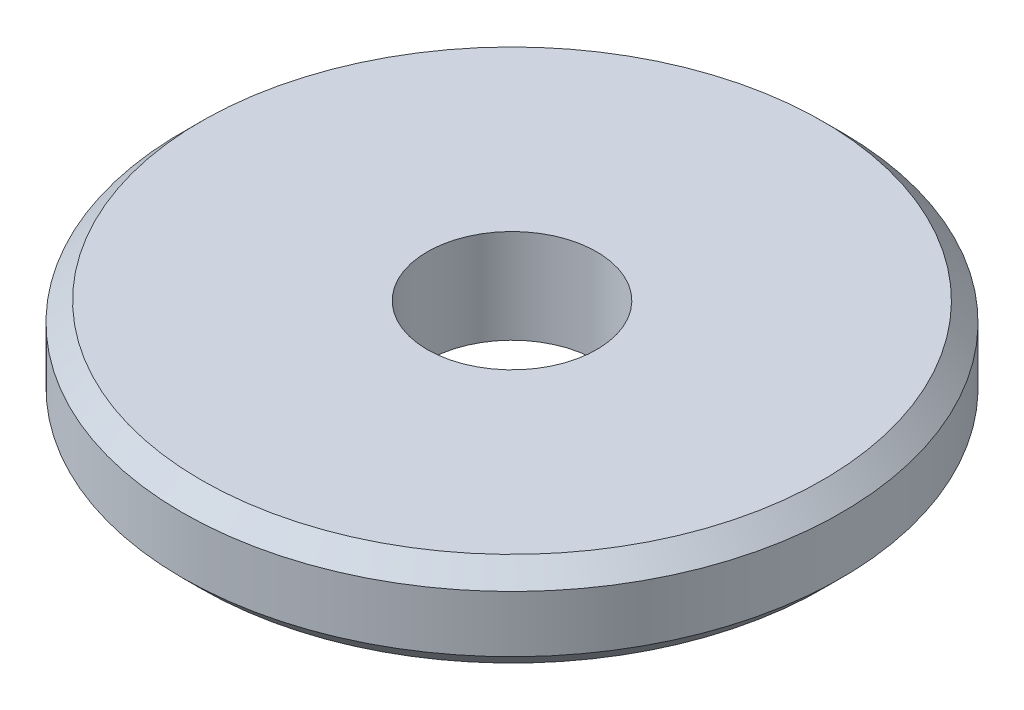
ISO-10303-21;
HEADER;
FILE_DESCRIPTION(('STEP AP214'),'2;1');
FILE_NAME('part.step','',(''),(''),'','','');
FILE_SCHEMA(('AUTOMOTIVE_DESIGN { 1 0 10303 214 1 1 1 1 }'));
ENDSEC;
DATA;
#1=APPLICATION_CONTEXT('core data for automotive mechanical design processes');
#2=APPLICATION_PROTOCOL_DEFINITION('international standard','automotive_design',2000,#1);
#3=PRODUCT_CONTEXT('',#1,'mechanical');
#4=PRODUCT('Part','Part','',(#3));
#5=PRODUCT_RELATED_PRODUCT_CATEGORY('part','',(#4));
#6=PRODUCT_DEFINITION_FORMATION('','',#4);
#7=PRODUCT_DEFINITION_CONTEXT('part definition',#1,'design');
#8=PRODUCT_DEFINITION('design','',#6,#7);
#9=PRODUCT_DEFINITION_SHAPE('','',#8);
#10=(LENGTH_UNIT() NAMED_UNIT(*) SI_UNIT(.MILLI.,.METRE.));
#11=(NAMED_UNIT(*) PLANE_ANGLE_UNIT() SI_UNIT($,.RADIAN.));
#12=(NAMED_UNIT(*) SI_UNIT($,.STERADIAN.) SOLID_ANGLE_UNIT());
#13=UNCERTAINTY_MEASURE_WITH_UNIT(LENGTH_MEASURE(1.E-05),#10,'distance_accuracy_value','');
#14=(GEOMETRIC_REPRESENTATION_CONTEXT(3) GLOBAL_UNCERTAINTY_ASSIGNED_CONTEXT((#13)) GLOBAL_UNIT_ASSIGNED_CONTEXT((#10,
#11,#12)) REPRESENTATION_CONTEXT('',''));
#15=CARTESIAN_POINT('',(0.,0.,0.));
#16=DIRECTION('',(0.,0.,1.));
#17=DIRECTION('',(1.,0.,0.));
#18=AXIS2_PLACEMENT_3D('',#15,#16,#17);
#19=CARTESIAN_POINT('',(0.,5.,0.));
#20=DIRECTION('',(0.,1.,0.));
#21=DIRECTION('',(0.,0.,1.));
#22=AXIS2_PLACEMENT_3D('',#19,#20,#21);
#23=PLANE('',#22);
#24=CARTESIAN_POINT('',(0.,5.,0.));
#25=DIRECTION('',(0.,1.,0.));
#26=DIRECTION('',(0.,0.,1.));
#27=AXIS2_PLACEMENT_3D('',#24,#25,#26);
#28=CIRCLE('',#27,16.5);
#29=CARTESIAN_POINT('',(0.,5.,16.5));
#30=VERTEX_POINT('',#29);
#31=EDGE_CURVE('E10',#30,#30,#28,.T.);
#32=ORIENTED_EDGE('',*,*,#31,.T.);
#33=EDGE_LOOP('',(#32));
#34=FACE_BOUND('',#33,.T.);
#35=CARTESIAN_POINT('',(0.,5.,0.));
#36=DIRECTION('',(0.,1.,0.));
#37=DIRECTION('',(0.,0.,1.));
#38=AXIS2_PLACEMENT_3D('',#35,#36,#37);
#39=CIRCLE('',#38,4.5);
#40=CARTESIAN_POINT('',(0.,5.,4.5));
#41=VERTEX_POINT('',#40);
#42=EDGE_CURVE('E49',#41,#41,#39,.T.);
#43=ORIENTED_EDGE('',*,*,#42,.F.);
#44=EDGE_LOOP('',(#43));
#45=FACE_BOUND('',#44,.T.);
#46=ADVANCED_FACE('F29',(#34,#45),#23,.T.);
#47=CARTESIAN_POINT('',(0.,0.,0.));
#48=DIRECTION('',(0.,1.,0.));
#49=DIRECTION('',(0.,0.,1.));
#50=AXIS2_PLACEMENT_3D('',#47,#48,#49);
#51=PLANE('',#50);
#52=CARTESIAN_POINT('',(0.,0.,0.));
#53=DIRECTION('',(0.,1.,0.));
#54=DIRECTION('',(0.,0.,1.));
#55=AXIS2_PLACEMENT_3D('',#52,#53,#54);
#56=CIRCLE('',#55,16.5);
#57=CARTESIAN_POINT('',(0.,0.,16.5));
#58=VERTEX_POINT('',#57);
#59=EDGE_CURVE('E36',#58,#58,#56,.F.);
#60=ORIENTED_EDGE('',*,*,#59,.T.);
#61=EDGE_LOOP('',(#60));
#62=FACE_BOUND('',#61,.T.);
#63=CARTESIAN_POINT('',(0.,0.,0.));
#64=DIRECTION('',(0.,1.,0.));
#65=DIRECTION('',(0.,0.,1.));
#66=AXIS2_PLACEMENT_3D('',#63,#64,#65);
#67=CIRCLE('',#66,4.5);
#68=CARTESIAN_POINT('',(0.,0.,4.5));
#69=VERTEX_POINT('',#68);
#70=EDGE_CURVE('E50',#69,#69,#67,.T.);
#71=ORIENTED_EDGE('',*,*,#70,.T.);
#72=EDGE_LOOP('',(#71));
#73=FACE_BOUND('',#72,.T.);
#74=ADVANCED_FACE('F60',(#62,#73),#51,.F.);
#75=CARTESIAN_POINT('',(0.,5.,0.));
#76=DIRECTION('',(0.,-1.,0.));
#77=DIRECTION('',(0.,0.,-1.));
#78=AXIS2_PLACEMENT_3D('',#75,#76,#77);
#79=CYLINDRICAL_SURFACE('',#78,17.5);
#80=CARTESIAN_POINT('',(0.,1.00000000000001,0.));
#81=DIRECTION('',(0.,1.,0.));
#82=DIRECTION('',(0.,0.,1.));
#83=AXIS2_PLACEMENT_3D('',#80,#81,#82);
#84=CIRCLE('',#83,17.5);
#85=CARTESIAN_POINT('',(0.,1.00000000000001,17.5));
#86=VERTEX_POINT('',#85);
#87=EDGE_CURVE('E40',#86,#86,#84,.T.);
#88=ORIENTED_EDGE('',*,*,#87,.T.);
#89=EDGE_LOOP('',(#88));
#90=FACE_BOUND('',#89,.T.);
#91=CARTESIAN_POINT('',(0.,4.,0.));
#92=DIRECTION('',(0.,1.,0.));
#93=DIRECTION('',(0.,0.,1.));
#94=AXIS2_PLACEMENT_3D('',#91,#92,#93);
#95=CIRCLE('',#94,17.5);
#96=CARTESIAN_POINT('',(0.,4.,17.5));
#97=VERTEX_POINT('',#96);
#98=EDGE_CURVE('E44',#97,#97,#95,.F.);
#99=ORIENTED_EDGE('',*,*,#98,.T.);
#100=EDGE_LOOP('',(#99));
#101=FACE_BOUND('',#100,.T.);
#102=ADVANCED_FACE('F65',(#90,#101),#79,.T.);
#103=CARTESIAN_POINT('',(0.,5.,0.));
#104=DIRECTION('',(0.,-1.,0.));
#105=DIRECTION('',(0.,0.,-1.));
#106=AXIS2_PLACEMENT_3D('',#103,#104,#105);
#107=CYLINDRICAL_SURFACE('',#106,4.5);
#108=ORIENTED_EDGE('',*,*,#42,.T.);
#109=EDGE_LOOP('',(#108));
#110=FACE_BOUND('',#109,.T.);
#111=ORIENTED_EDGE('',*,*,#70,.F.);
#112=EDGE_LOOP('',(#111));
#113=FACE_BOUND('',#112,.T.);
#114=ADVANCED_FACE('F56',(#110,#113),#107,.F.);
#115=CARTESIAN_POINT('',(0.,1.00000000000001,0.));
#116=DIRECTION('',(0.,1.,0.));
#117=DIRECTION('',(0.,0.,1.));
#118=AXIS2_PLACEMENT_3D('',#115,#116,#117);
#119=CONICAL_SURFACE('',#118,17.5,0.785398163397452);
#120=ORIENTED_EDGE('',*,*,#59,.F.);
#121=EDGE_LOOP('',(#120));
#122=FACE_BOUND('',#121,.T.);
#123=ORIENTED_EDGE('',*,*,#87,.F.);
#124=EDGE_LOOP('',(#123));
#125=FACE_BOUND('',#124,.T.);
#126=ADVANCED_FACE('F71',(#122,#125),#119,.T.);
#127=CARTESIAN_POINT('',(0.,5.,0.));
#128=DIRECTION('',(0.,-1.,0.));
#129=DIRECTION('',(0.,0.,-1.));
#130=AXIS2_PLACEMENT_3D('',#127,#128,#129);
#131=CONICAL_SURFACE('',#130,16.5,0.785398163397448);
#132=ORIENTED_EDGE('',*,*,#98,.F.);
#133=EDGE_LOOP('',(#132));
#134=FACE_BOUND('',#133,.T.);
#135=ORIENTED_EDGE('',*,*,#31,.F.);
#136=EDGE_LOOP('',(#135));
#137=FACE_BOUND('',#136,.T.);
#138=ADVANCED_FACE('F31',(#134,#137),#131,.T.);
#139=CLOSED_SHELL('',(#46,#74,#102,#114,#126,#138));
#140=MANIFOLD_SOLID_BREP('B2',#139);
#141=ADVANCED_BREP_SHAPE_REPRESENTATION('',(#18,#140),#14);
#142=SHAPE_DEFINITION_REPRESENTATION(#9,#141);
ENDSEC;
END-ISO-10303-21;
